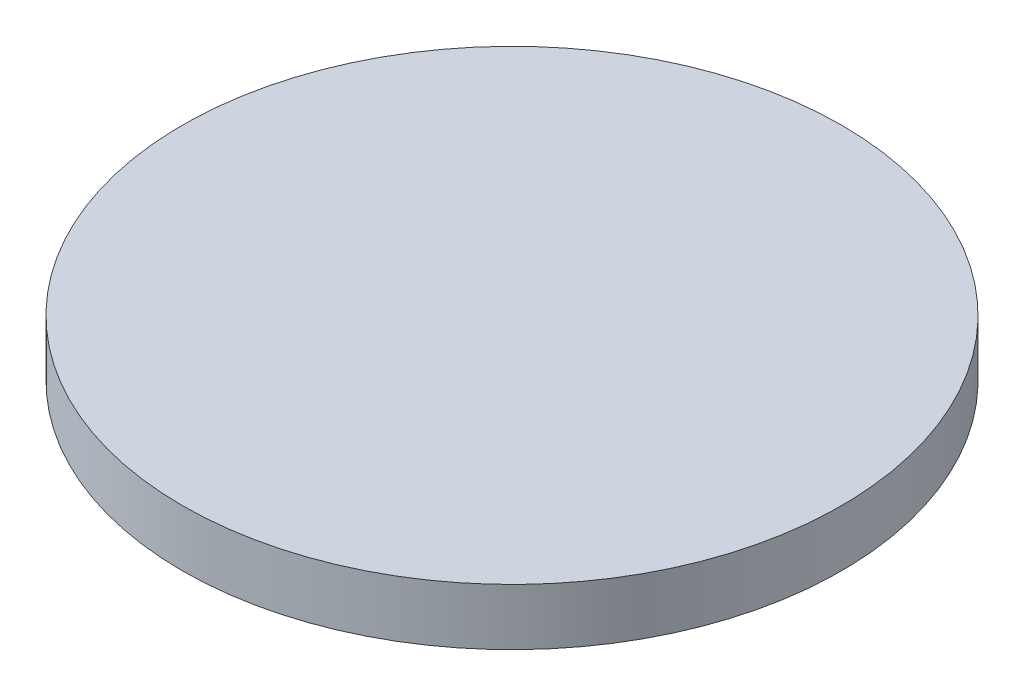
ISO-10303-21;
HEADER;
FILE_DESCRIPTION(('STEP AP214'),'2;1');
FILE_NAME('part.step','',(''),(''),'','','');
FILE_SCHEMA(('AUTOMOTIVE_DESIGN { 1 0 10303 214 1 1 1 1 }'));
ENDSEC;
DATA;
#1=APPLICATION_CONTEXT('core data for automotive mechanical design processes');
#2=APPLICATION_PROTOCOL_DEFINITION('international standard','automotive_design',2000,#1);
#3=PRODUCT_CONTEXT('',#1,'mechanical');
#4=PRODUCT('Part','Part','',(#3));
#5=PRODUCT_RELATED_PRODUCT_CATEGORY('part','',(#4));
#6=PRODUCT_DEFINITION_FORMATION('','',#4);
#7=PRODUCT_DEFINITION_CONTEXT('part definition',#1,'design');
#8=PRODUCT_DEFINITION('design','',#6,#7);
#9=PRODUCT_DEFINITION_SHAPE('','',#8);
#10=(LENGTH_UNIT() NAMED_UNIT(*) SI_UNIT(.MILLI.,.METRE.));
#11=(NAMED_UNIT(*) PLANE_ANGLE_UNIT() SI_UNIT($,.RADIAN.));
#12=(NAMED_UNIT(*) SI_UNIT($,.STERADIAN.) SOLID_ANGLE_UNIT());
#13=UNCERTAINTY_MEASURE_WITH_UNIT(LENGTH_MEASURE(1.E-05),#10,'distance_accuracy_value','');
#14=(GEOMETRIC_REPRESENTATION_CONTEXT(3) GLOBAL_UNCERTAINTY_ASSIGNED_CONTEXT((#13)) GLOBAL_UNIT_ASSIGNED_CONTEXT((#10,
#11,#12)) REPRESENTATION_CONTEXT('',''));
#15=CARTESIAN_POINT('',(0.,0.,0.));
#16=DIRECTION('',(0.,0.,1.));
#17=DIRECTION('',(1.,0.,0.));
#18=AXIS2_PLACEMENT_3D('',#15,#16,#17);
#19=CARTESIAN_POINT('',(0.,30.,0.));
#20=DIRECTION('',(0.,-1.,0.));
#21=DIRECTION('',(0.,0.,-1.));
#22=AXIS2_PLACEMENT_3D('',#19,#20,#21);
#23=CYLINDRICAL_SURFACE('',#22,175.);
#24=CARTESIAN_POINT('',(0.,30.,0.));
#25=DIRECTION('',(0.,1.,0.));
#26=DIRECTION('',(0.,0.,1.));
#27=AXIS2_PLACEMENT_3D('',#24,#25,#26);
#28=CIRCLE('',#27,175.);
#29=CARTESIAN_POINT('',(0.,30.,175.));
#30=VERTEX_POINT('',#29);
#31=EDGE_CURVE('E10',#30,#30,#28,.T.);
#32=ORIENTED_EDGE('',*,*,#31,.F.);
#33=EDGE_LOOP('',(#32));
#34=FACE_BOUND('',#33,.T.);
#35=CARTESIAN_POINT('',(0.,0.,0.));
#36=DIRECTION('',(0.,1.,0.));
#37=DIRECTION('',(0.,0.,1.));
#38=AXIS2_PLACEMENT_3D('',#35,#36,#37);
#39=CIRCLE('',#38,175.);
#40=CARTESIAN_POINT('',(0.,0.,175.));
#41=VERTEX_POINT('',#40);
#42=EDGE_CURVE('E35',#41,#41,#39,.T.);
#43=ORIENTED_EDGE('',*,*,#42,.T.);
#44=EDGE_LOOP('',(#43));
#45=FACE_BOUND('',#44,.T.);
#46=ADVANCED_FACE('F29',(#34,#45),#23,.T.);
#47=CARTESIAN_POINT('',(0.,30.,0.));
#48=DIRECTION('',(0.,1.,0.));
#49=DIRECTION('',(0.,0.,1.));
#50=AXIS2_PLACEMENT_3D('',#47,#48,#49);
#51=PLANE('',#50);
#52=ORIENTED_EDGE('',*,*,#31,.T.);
#53=EDGE_LOOP('',(#52));
#54=FACE_BOUND('',#53,.T.);
#55=ADVANCED_FACE('F44',(#54),#51,.T.);
#56=CARTESIAN_POINT('',(0.,0.,0.));
#57=DIRECTION('',(0.,1.,0.));
#58=DIRECTION('',(0.,0.,1.));
#59=AXIS2_PLACEMENT_3D('',#56,#57,#58);
#60=PLANE('',#59);
#61=ORIENTED_EDGE('',*,*,#42,.F.);
#62=EDGE_LOOP('',(#61));
#63=FACE_BOUND('',#62,.T.);
#64=ADVANCED_FACE('F42',(#63),#60,.F.);
#65=CLOSED_SHELL('',(#46,#55,#64));
#66=MANIFOLD_SOLID_BREP('B2',#65);
#67=ADVANCED_BREP_SHAPE_REPRESENTATION('',(#18,#66),#14);
#68=SHAPE_DEFINITION_REPRESENTATION(#9,#67);
ENDSEC;
END-ISO-10303-21;
